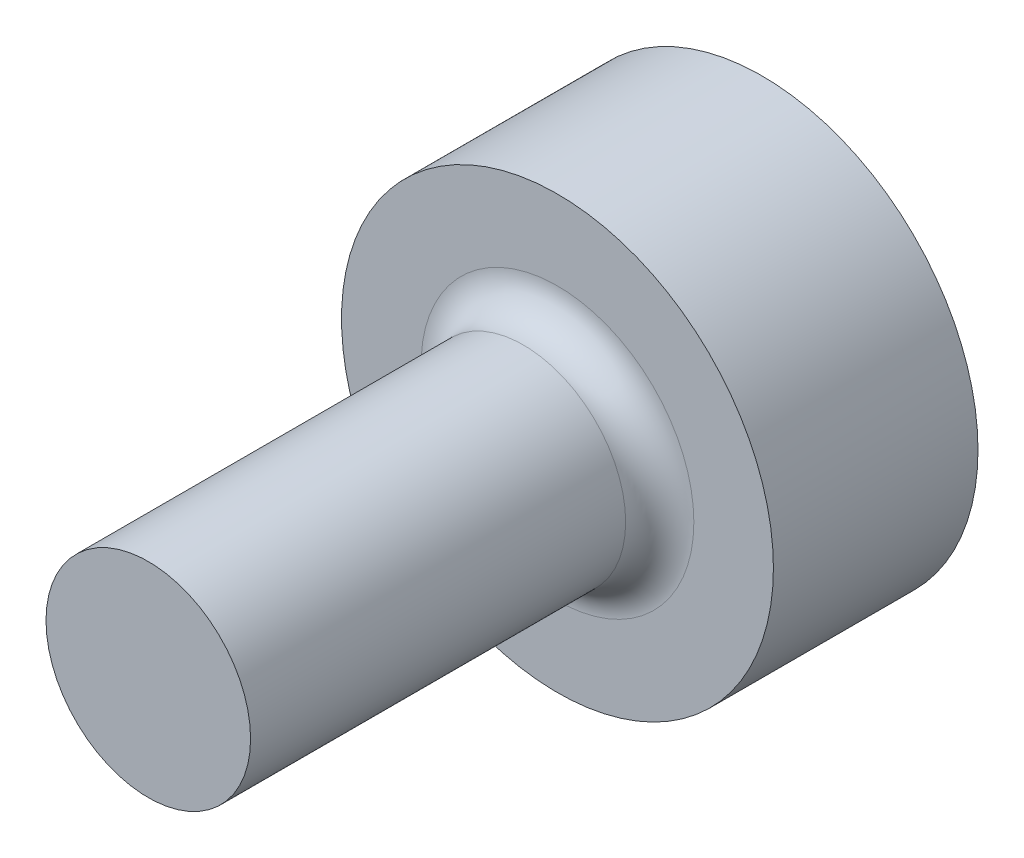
from build123d import *


with BuildPart() as part:
    # Sketch1 → Revolve1 (revolve)
    with BuildSketch(Plane(origin=(0, 0, 0), x_dir=(0, 0, -1), z_dir=(1, 0, 0)), mode=Mode.PRIVATE) as revolve1_sk:
        with BuildLine():
            Line((-36, 0), (18, 0))
            Line((18, 0), (18, 19))
            Line((18, 19), (0, 19))
            Line((0, 19), (0, 12))
            ThreePointArc((0, 12), (-0.878679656, 9.878679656), (-3, 9))
            Line((-3, 9), (-36, 9))
            Line((-36, 9), (-36, 0))
        make_face()
    revolve(revolve1_sk.sketch.rotate(Axis((0, 0, 36), (0, 0, -1)), 90), axis=Axis((0, 0, 36), (0, 0, -1)))


solid = part.part
